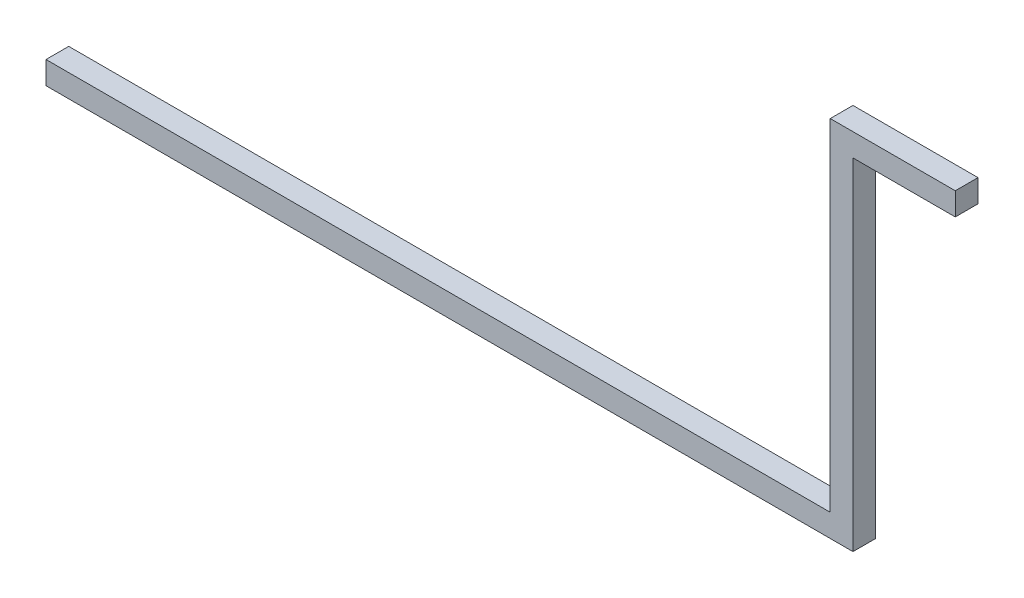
ISO-10303-21;
HEADER;
FILE_DESCRIPTION(('STEP AP214'),'2;1');
FILE_NAME('part.step','',(''),(''),'','','');
FILE_SCHEMA(('AUTOMOTIVE_DESIGN { 1 0 10303 214 1 1 1 1 }'));
ENDSEC;
DATA;
#1=APPLICATION_CONTEXT('core data for automotive mechanical design processes');
#2=APPLICATION_PROTOCOL_DEFINITION('international standard','automotive_design',2000,#1);
#3=PRODUCT_CONTEXT('',#1,'mechanical');
#4=PRODUCT('Part','Part','',(#3));
#5=PRODUCT_RELATED_PRODUCT_CATEGORY('part','',(#4));
#6=PRODUCT_DEFINITION_FORMATION('','',#4);
#7=PRODUCT_DEFINITION_CONTEXT('part definition',#1,'design');
#8=PRODUCT_DEFINITION('design','',#6,#7);
#9=PRODUCT_DEFINITION_SHAPE('','',#8);
#10=(LENGTH_UNIT() NAMED_UNIT(*) SI_UNIT(.MILLI.,.METRE.));
#11=(NAMED_UNIT(*) PLANE_ANGLE_UNIT() SI_UNIT($,.RADIAN.));
#12=(NAMED_UNIT(*) SI_UNIT($,.STERADIAN.) SOLID_ANGLE_UNIT());
#13=UNCERTAINTY_MEASURE_WITH_UNIT(LENGTH_MEASURE(1.E-05),#10,'distance_accuracy_value','');
#14=(GEOMETRIC_REPRESENTATION_CONTEXT(3) GLOBAL_UNCERTAINTY_ASSIGNED_CONTEXT((#13)) GLOBAL_UNIT_ASSIGNED_CONTEXT((#10,
#11,#12)) REPRESENTATION_CONTEXT('',''));
#15=CARTESIAN_POINT('',(0.,0.,0.));
#16=DIRECTION('',(0.,0.,1.));
#17=DIRECTION('',(1.,0.,0.));
#18=AXIS2_PLACEMENT_3D('',#15,#16,#17);
#19=CARTESIAN_POINT('',(-50.0000000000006,145.,10.));
#20=DIRECTION('',(0.,1.,0.));
#21=DIRECTION('',(0.,0.,1.));
#22=AXIS2_PLACEMENT_3D('',#19,#20,#21);
#23=PLANE('',#22);
#24=DIRECTION('',(1.,0.,0.));
#25=VECTOR('',#24,1.);
#26=CARTESIAN_POINT('',(-50.0000000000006,145.,0.));
#27=LINE('',#26,#25);
#28=CARTESIAN_POINT('',(-45.0000000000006,145.,0.));
#29=VERTEX_POINT('',#28);
#30=CARTESIAN_POINT('',(0.,145.,0.));
#31=VERTEX_POINT('',#30);
#32=EDGE_CURVE('E130',#29,#31,#27,.T.);
#33=ORIENTED_EDGE('',*,*,#32,.T.);
#34=DIRECTION('',(0.,0.,-1.));
#35=VECTOR('',#34,1.);
#36=CARTESIAN_POINT('',(0.,145.,10.));
#37=LINE('',#36,#35);
#38=CARTESIAN_POINT('',(0.,145.,10.));
#39=VERTEX_POINT('',#38);
#40=EDGE_CURVE('E11',#39,#31,#37,.T.);
#41=ORIENTED_EDGE('',*,*,#40,.F.);
#42=DIRECTION('',(1.,0.,0.));
#43=VECTOR('',#42,1.);
#44=CARTESIAN_POINT('',(-50.0000000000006,145.,10.));
#45=LINE('',#44,#43);
#46=CARTESIAN_POINT('',(-45.0000000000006,145.,10.));
#47=VERTEX_POINT('',#46);
#48=EDGE_CURVE('E88',#47,#39,#45,.T.);
#49=ORIENTED_EDGE('',*,*,#48,.F.);
#50=DIRECTION('',(0.,0.,-1.));
#51=VECTOR('',#50,1.);
#52=CARTESIAN_POINT('',(-45.0000000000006,145.,10.));
#53=LINE('',#52,#51);
#54=EDGE_CURVE('E129',#47,#29,#53,.T.);
#55=ORIENTED_EDGE('',*,*,#54,.T.);
#56=EDGE_LOOP('',(#33,#41,#49,#55));
#57=FACE_BOUND('',#56,.T.);
#58=ADVANCED_FACE('F33',(#57),#23,.F.);
#59=CARTESIAN_POINT('',(0.,155.,10.));
#60=DIRECTION('',(1.,0.,0.));
#61=DIRECTION('',(0.,0.,-1.));
#62=AXIS2_PLACEMENT_3D('',#59,#60,#61);
#63=PLANE('',#62);
#64=DIRECTION('',(0.,-1.,0.));
#65=VECTOR('',#64,1.);
#66=CARTESIAN_POINT('',(0.,155.,0.));
#67=LINE('',#66,#65);
#68=CARTESIAN_POINT('',(0.,155.,0.));
#69=VERTEX_POINT('',#68);
#70=EDGE_CURVE('E133',#69,#31,#67,.T.);
#71=ORIENTED_EDGE('',*,*,#70,.F.);
#72=DIRECTION('',(0.,0.,-1.));
#73=VECTOR('',#72,1.);
#74=CARTESIAN_POINT('',(0.,155.,10.));
#75=LINE('',#74,#73);
#76=CARTESIAN_POINT('',(0.,155.,10.));
#77=VERTEX_POINT('',#76);
#78=EDGE_CURVE('E41',#77,#69,#75,.T.);
#79=ORIENTED_EDGE('',*,*,#78,.F.);
#80=DIRECTION('',(0.,-1.,0.));
#81=VECTOR('',#80,1.);
#82=CARTESIAN_POINT('',(0.,155.,10.));
#83=LINE('',#82,#81);
#84=EDGE_CURVE('E172',#77,#39,#83,.T.);
#85=ORIENTED_EDGE('',*,*,#84,.T.);
#86=ORIENTED_EDGE('',*,*,#40,.T.);
#87=EDGE_LOOP('',(#71,#79,#85,#86));
#88=FACE_BOUND('',#87,.T.);
#89=ADVANCED_FACE('F163',(#88),#63,.T.);
#90=CARTESIAN_POINT('',(-50.0000000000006,155.,10.));
#91=DIRECTION('',(0.,1.,0.));
#92=DIRECTION('',(0.,0.,1.));
#93=AXIS2_PLACEMENT_3D('',#90,#91,#92);
#94=PLANE('',#93);
#95=DIRECTION('',(1.,0.,0.));
#96=VECTOR('',#95,1.);
#97=CARTESIAN_POINT('',(-50.0000000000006,155.,0.));
#98=LINE('',#97,#96);
#99=CARTESIAN_POINT('',(-55.0000000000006,155.,0.));
#100=VERTEX_POINT('',#99);
#101=EDGE_CURVE('E136',#100,#69,#98,.T.);
#102=ORIENTED_EDGE('',*,*,#101,.F.);
#103=DIRECTION('',(0.,0.,-1.));
#104=VECTOR('',#103,1.);
#105=CARTESIAN_POINT('',(-55.0000000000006,155.,10.));
#106=LINE('',#105,#104);
#107=CARTESIAN_POINT('',(-55.0000000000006,155.,10.));
#108=VERTEX_POINT('',#107);
#109=EDGE_CURVE('E153',#108,#100,#106,.T.);
#110=ORIENTED_EDGE('',*,*,#109,.F.);
#111=DIRECTION('',(1.,0.,0.));
#112=VECTOR('',#111,1.);
#113=CARTESIAN_POINT('',(-50.0000000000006,155.,10.));
#114=LINE('',#113,#112);
#115=EDGE_CURVE('E160',#108,#77,#114,.T.);
#116=ORIENTED_EDGE('',*,*,#115,.T.);
#117=ORIENTED_EDGE('',*,*,#78,.T.);
#118=EDGE_LOOP('',(#102,#110,#116,#117));
#119=FACE_BOUND('',#118,.T.);
#120=ADVANCED_FACE('F158',(#119),#94,.T.);
#121=CARTESIAN_POINT('',(-55.,0.,10.));
#122=DIRECTION('',(-1.,0.,0.));
#123=DIRECTION('',(0.,-1.,0.));
#124=AXIS2_PLACEMENT_3D('',#121,#122,#123);
#125=PLANE('',#124);
#126=DIRECTION('',(0.,1.,0.));
#127=VECTOR('',#126,1.);
#128=CARTESIAN_POINT('',(-55.,0.,0.));
#129=LINE('',#128,#127);
#130=CARTESIAN_POINT('',(-55.0000000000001,5.,0.));
#131=VERTEX_POINT('',#130);
#132=EDGE_CURVE('E139',#131,#100,#129,.T.);
#133=ORIENTED_EDGE('',*,*,#132,.F.);
#134=DIRECTION('',(0.,0.,-1.));
#135=VECTOR('',#134,1.);
#136=CARTESIAN_POINT('',(-55.0000000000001,5.,10.));
#137=LINE('',#136,#135);
#138=CARTESIAN_POINT('',(-55.0000000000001,5.,10.));
#139=VERTEX_POINT('',#138);
#140=EDGE_CURVE('E151',#139,#131,#137,.T.);
#141=ORIENTED_EDGE('',*,*,#140,.F.);
#142=DIRECTION('',(0.,1.,0.));
#143=VECTOR('',#142,1.);
#144=CARTESIAN_POINT('',(-55.,0.,10.));
#145=LINE('',#144,#143);
#146=EDGE_CURVE('E124',#139,#108,#145,.T.);
#147=ORIENTED_EDGE('',*,*,#146,.T.);
#148=ORIENTED_EDGE('',*,*,#109,.T.);
#149=EDGE_LOOP('',(#133,#141,#147,#148));
#150=FACE_BOUND('',#149,.T.);
#151=ADVANCED_FACE('F170',(#150),#125,.T.);
#152=CARTESIAN_POINT('',(-400.,5.,10.));
#153=DIRECTION('',(0.,1.,0.));
#154=DIRECTION('',(0.,0.,1.));
#155=AXIS2_PLACEMENT_3D('',#152,#153,#154);
#156=PLANE('',#155);
#157=DIRECTION('',(1.,0.,0.));
#158=VECTOR('',#157,1.);
#159=CARTESIAN_POINT('',(-400.,5.,0.));
#160=LINE('',#159,#158);
#161=CARTESIAN_POINT('',(-400.,5.,0.));
#162=VERTEX_POINT('',#161);
#163=EDGE_CURVE('E142',#162,#131,#160,.T.);
#164=ORIENTED_EDGE('',*,*,#163,.F.);
#165=DIRECTION('',(0.,0.,-1.));
#166=VECTOR('',#165,1.);
#167=CARTESIAN_POINT('',(-400.,5.,10.));
#168=LINE('',#167,#166);
#169=CARTESIAN_POINT('',(-400.,5.,10.));
#170=VERTEX_POINT('',#169);
#171=EDGE_CURVE('E112',#170,#162,#168,.T.);
#172=ORIENTED_EDGE('',*,*,#171,.F.);
#173=DIRECTION('',(1.,0.,0.));
#174=VECTOR('',#173,1.);
#175=CARTESIAN_POINT('',(-400.,5.,10.));
#176=LINE('',#175,#174);
#177=EDGE_CURVE('E122',#170,#139,#176,.T.);
#178=ORIENTED_EDGE('',*,*,#177,.T.);
#179=ORIENTED_EDGE('',*,*,#140,.T.);
#180=EDGE_LOOP('',(#164,#172,#178,#179));
#181=FACE_BOUND('',#180,.T.);
#182=ADVANCED_FACE('F177',(#181),#156,.T.);
#183=CARTESIAN_POINT('',(-400.,-5.,10.));
#184=DIRECTION('',(-1.,0.,0.));
#185=DIRECTION('',(0.,0.,1.));
#186=AXIS2_PLACEMENT_3D('',#183,#184,#185);
#187=PLANE('',#186);
#188=DIRECTION('',(0.,1.,0.));
#189=VECTOR('',#188,1.);
#190=CARTESIAN_POINT('',(-400.,-5.,0.));
#191=LINE('',#190,#189);
#192=CARTESIAN_POINT('',(-400.,-5.,0.));
#193=VERTEX_POINT('',#192);
#194=EDGE_CURVE('E111',#193,#162,#191,.T.);
#195=ORIENTED_EDGE('',*,*,#194,.F.);
#196=DIRECTION('',(0.,0.,-1.));
#197=VECTOR('',#196,1.);
#198=CARTESIAN_POINT('',(-400.,-5.,10.));
#199=LINE('',#198,#197);
#200=CARTESIAN_POINT('',(-400.,-5.,10.));
#201=VERTEX_POINT('',#200);
#202=EDGE_CURVE('E105',#201,#193,#199,.T.);
#203=ORIENTED_EDGE('',*,*,#202,.F.);
#204=DIRECTION('',(0.,1.,0.));
#205=VECTOR('',#204,1.);
#206=CARTESIAN_POINT('',(-400.,-5.,10.));
#207=LINE('',#206,#205);
#208=EDGE_CURVE('E109',#201,#170,#207,.T.);
#209=ORIENTED_EDGE('',*,*,#208,.T.);
#210=ORIENTED_EDGE('',*,*,#171,.T.);
#211=EDGE_LOOP('',(#195,#203,#209,#210));
#212=FACE_BOUND('',#211,.T.);
#213=ADVANCED_FACE('F107',(#212),#187,.T.);
#214=CARTESIAN_POINT('',(-400.,-5.,10.));
#215=DIRECTION('',(0.,1.,0.));
#216=DIRECTION('',(0.,0.,1.));
#217=AXIS2_PLACEMENT_3D('',#214,#215,#216);
#218=PLANE('',#217);
#219=DIRECTION('',(1.,0.,0.));
#220=VECTOR('',#219,1.);
#221=CARTESIAN_POINT('',(-400.,-5.,0.));
#222=LINE('',#221,#220);
#223=CARTESIAN_POINT('',(-45.,-5.,0.));
#224=VERTEX_POINT('',#223);
#225=EDGE_CURVE('E76',#193,#224,#222,.T.);
#226=ORIENTED_EDGE('',*,*,#225,.T.);
#227=DIRECTION('',(0.,0.,-1.));
#228=VECTOR('',#227,1.);
#229=CARTESIAN_POINT('',(-45.,-5.,10.));
#230=LINE('',#229,#228);
#231=CARTESIAN_POINT('',(-45.,-5.,10.));
#232=VERTEX_POINT('',#231);
#233=EDGE_CURVE('E113',#232,#224,#230,.T.);
#234=ORIENTED_EDGE('',*,*,#233,.F.);
#235=DIRECTION('',(1.,0.,0.));
#236=VECTOR('',#235,1.);
#237=CARTESIAN_POINT('',(-400.,-5.,10.));
#238=LINE('',#237,#236);
#239=EDGE_CURVE('E115',#201,#232,#238,.T.);
#240=ORIENTED_EDGE('',*,*,#239,.F.);
#241=ORIENTED_EDGE('',*,*,#202,.T.);
#242=EDGE_LOOP('',(#226,#234,#240,#241));
#243=FACE_BOUND('',#242,.T.);
#244=ADVANCED_FACE('F116',(#243),#218,.F.);
#245=CARTESIAN_POINT('',(-45.,0.,10.));
#246=DIRECTION('',(-1.,0.,0.));
#247=DIRECTION('',(0.,-1.,0.));
#248=AXIS2_PLACEMENT_3D('',#245,#246,#247);
#249=PLANE('',#248);
#250=DIRECTION('',(0.,1.,0.));
#251=VECTOR('',#250,1.);
#252=CARTESIAN_POINT('',(-45.,0.,0.));
#253=LINE('',#252,#251);
#254=EDGE_CURVE('E82',#224,#29,#253,.T.);
#255=ORIENTED_EDGE('',*,*,#254,.T.);
#256=ORIENTED_EDGE('',*,*,#54,.F.);
#257=DIRECTION('',(0.,1.,0.));
#258=VECTOR('',#257,1.);
#259=CARTESIAN_POINT('',(-45.,0.,10.));
#260=LINE('',#259,#258);
#261=EDGE_CURVE('E49',#232,#47,#260,.T.);
#262=ORIENTED_EDGE('',*,*,#261,.F.);
#263=ORIENTED_EDGE('',*,*,#233,.T.);
#264=EDGE_LOOP('',(#255,#256,#262,#263));
#265=FACE_BOUND('',#264,.T.);
#266=ADVANCED_FACE('F179',(#265),#249,.F.);
#267=CARTESIAN_POINT('',(0.,0.,10.));
#268=DIRECTION('',(0.,0.,-1.));
#269=DIRECTION('',(-1.,0.,0.));
#270=AXIS2_PLACEMENT_3D('',#267,#268,#269);
#271=PLANE('',#270);
#272=ORIENTED_EDGE('',*,*,#48,.T.);
#273=ORIENTED_EDGE('',*,*,#84,.F.);
#274=ORIENTED_EDGE('',*,*,#115,.F.);
#275=ORIENTED_EDGE('',*,*,#146,.F.);
#276=ORIENTED_EDGE('',*,*,#177,.F.);
#277=ORIENTED_EDGE('',*,*,#208,.F.);
#278=ORIENTED_EDGE('',*,*,#239,.T.);
#279=ORIENTED_EDGE('',*,*,#261,.T.);
#280=EDGE_LOOP('',(#272,#273,#274,#275,#276,#277,#278,#279));
#281=FACE_BOUND('',#280,.T.);
#282=ADVANCED_FACE('F119',(#281),#271,.F.);
#283=CARTESIAN_POINT('',(0.,0.,0.));
#284=DIRECTION('',(0.,0.,-1.));
#285=DIRECTION('',(-1.,0.,0.));
#286=AXIS2_PLACEMENT_3D('',#283,#284,#285);
#287=PLANE('',#286);
#288=ORIENTED_EDGE('',*,*,#32,.F.);
#289=ORIENTED_EDGE('',*,*,#254,.F.);
#290=ORIENTED_EDGE('',*,*,#225,.F.);
#291=ORIENTED_EDGE('',*,*,#194,.T.);
#292=ORIENTED_EDGE('',*,*,#163,.T.);
#293=ORIENTED_EDGE('',*,*,#132,.T.);
#294=ORIENTED_EDGE('',*,*,#101,.T.);
#295=ORIENTED_EDGE('',*,*,#70,.T.);
#296=EDGE_LOOP('',(#288,#289,#290,#291,#292,#293,#294,#295));
#297=FACE_BOUND('',#296,.T.);
#298=ADVANCED_FACE('F166',(#297),#287,.T.);
#299=CLOSED_SHELL('',(#58,#89,#120,#151,#182,#213,#244,#266,#282,#298));
#300=MANIFOLD_SOLID_BREP('B2',#299);
#301=ADVANCED_BREP_SHAPE_REPRESENTATION('',(#18,#300),#14);
#302=SHAPE_DEFINITION_REPRESENTATION(#9,#301);
ENDSEC;
END-ISO-10303-21;
